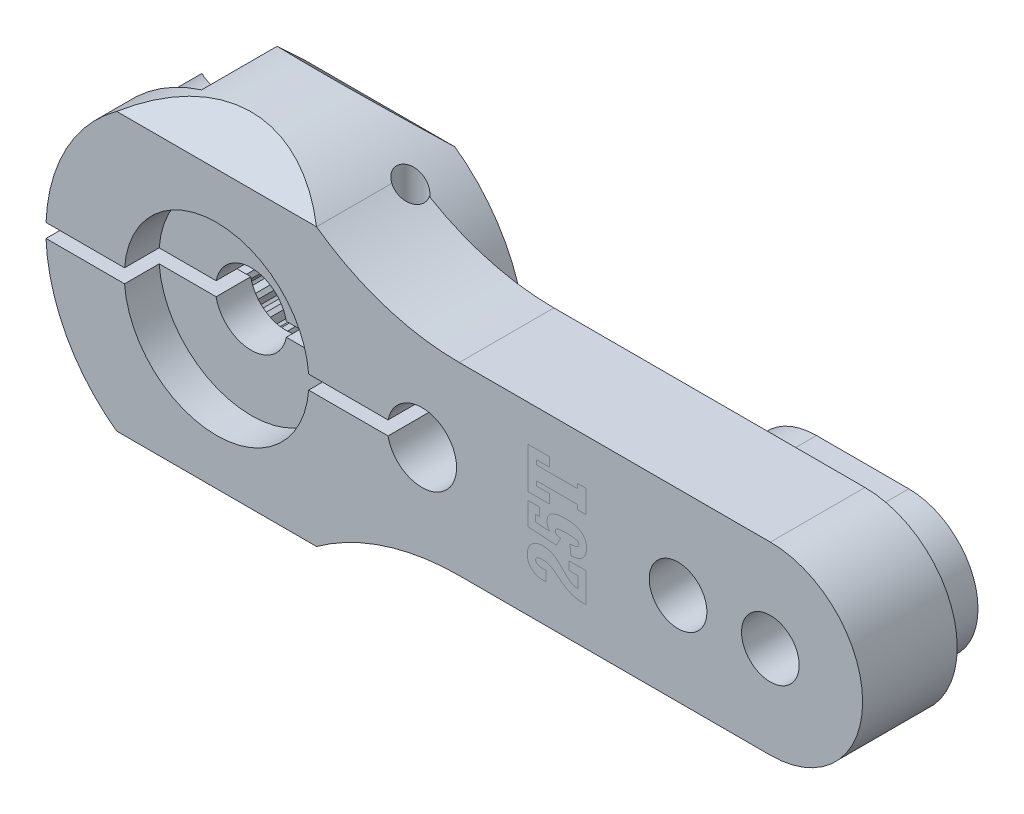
from build123d import *

# Parameters (mm, degrees)
SKETCH1_R                    = 7.4
SKETCH1_R_2                  = 1.55
BOSS_EXTRUDE1_DEPTH          = 6
SKETCH2_R                    = 1.55
BOSS_EXTRUDE2_DEPTH          = 4.1
BOSS_EXTRUDE3_DEPTH          = 7
CUT_EXTRUDE1_START           = -3
SKETCH4_R                    = 2.65
CUT_EXTRUDE1_DEPTH           = 27.795301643
CHAMFER1_SIZE                = 0.45
CUT_EXTRUDE2_START           = -3
CUT_EXTRUDE2_DEPTH           = 27.795301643
CIRPATTERN1_COUNT            = 25
CUT_EXTRUDE3_START           = -1.6
CUT_EXTRUDE3_DEPTH           = 29.195301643
CUT_EXTRUDE4_DEPTH           = 30.795301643
CUT_EXTRUDE4_DEPTH_BACK      = 30.795301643
SKETCH7_R                    = 0.6
SKETCH8_R                    = 1.5
SKETCH8_R_2                  = 1.25
CUT_EXTRUDE5_DEPTH           = 30.795301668
CUT_EXTRUDE6_DEPTH           = 30.795301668
CUT_EXTRUDE6_DEPTH_BACK      = 30.795301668
SKETCH9_W                    = 20.948807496
SKETCH9_H                    = 0.6
CUT_EXTRUDE_THIN1_DEPTH      = 30.795301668
CUT_EXTRUDE_THIN1_DEPTH_BACK = 30.795301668
SKETCH11_R                   = 4
CUT_EXTRUDE7_DEPTH           = 1.5


with BuildPart() as part:
    # Sketch1 → Boss-Extrude1 (new body)
    with BuildSketch(Plane.XY):
        Circle(SKETCH1_R)
        Circle(SKETCH1_R_2, mode=Mode.SUBTRACT)
    extrude(amount=-BOSS_EXTRUDE1_DEPTH)

    # Sketch2 → Boss-Extrude2 (add)
    with BuildSketch(Plane.XY):
        with BuildLine():
            Line((24, 4), (10.518826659, 4))
            ThreePointArc((10.518826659, 4), (7.267453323, 4.512419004), (4.331281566, 6))
            ThreePointArc((4.331281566, 6), (-7.4, 0), (4.331281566, -6))
            ThreePointArc((4.331281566, -6), (7.267453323, -4.512419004), (10.518826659, -4))
            Line((10.518826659, -4), (24, -4))
            ThreePointArc((24, -4), (28, 0), (24, 4))
        make_face()
        Circle(SKETCH2_R, mode=Mode.SUBTRACT)
    extrude(amount=-BOSS_EXTRUDE2_DEPTH)

    # Sketch3 → Boss-Extrude3 (add)
    with BuildSketch(Plane.XY):
        with BuildLine():
            Line((20, 3), (24, 3))
            ThreePointArc((24, 3), (27, 0), (24, -3))
            Line((24, -3), (20, -3))
            ThreePointArc((20, -3), (17, 0), (20, 3))
        make_face()
    extrude(amount=-BOSS_EXTRUDE3_DEPTH)

    # Sketch4 → Cut-Extrude1 (cut, through all)
    with BuildSketch(Plane.XY.offset(CUT_EXTRUDE1_START)):
        Circle(SKETCH4_R)
    extrude(amount=-CUT_EXTRUDE1_DEPTH, mode=Mode.SUBTRACT)

    # Chamfer1
    chamfer1_edges = [part.edges().sort_by_distance(p)[0] for p in [
        (-2.65, 0, -6),
    ]]
    chamfer(chamfer1_edges, length=CHAMFER1_SIZE)

    # Sketch5 → Cut-Extrude2 (cut, through all)
    with BuildSketch(Plane.XY.offset(CUT_EXTRUDE2_START)):
        with BuildLine():
            Line((0.100653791, 2.648087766), (0.320281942, 3.033136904))
            ThreePointArc((0.320281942, 3.033136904), (0.382266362, 3.025949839), (0.444090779, 3.01749621))
            Line((0.444090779, 3.01749621), (0.561061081, 2.589924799))
            ThreePointArc((0.561061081, 2.589924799), (0.332133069, 2.629103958), (0.100653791, 2.648087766))
        make_face()
    cut_extrude2 = extrude(amount=-CUT_EXTRUDE2_DEPTH, mode=Mode.SUBTRACT)

    # CirPattern1: Cut-Extrude2 ×25 about axis
    cirpattern1_axis = Axis((0, 0, 0), (0, 0, 1))
    for i in range(1, CIRPATTERN1_COUNT):
        add(cut_extrude2.rotate(cirpattern1_axis, i * 360 / CIRPATTERN1_COUNT), mode=Mode.SUBTRACT)

    # Sketch6 → Cut-Extrude3 (cut, through all)
    with BuildSketch(Plane.XY.offset(CUT_EXTRUDE3_START)):
        with BuildLine():
            Line((3.25, -3), (5.95, -3))
            ThreePointArc((5.95, -3), (6.657106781, -3.292893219), (6.95, -4))
            Line((6.95, -4), (6.95, -12.29125861))
            Line((6.95, -12.29125861), (2.25, -12.29125861))
            Line((2.25, -12.29125861), (2.25, -4))
            ThreePointArc((2.25, -4), (2.542893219, -3.292893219), (3.25, -3))
        make_face()
        with BuildLine():
            Line((-6.95, 12.29125861), (-2.25, 12.29125861))
            Line((-2.25, 12.29125861), (-2.25, 4))
            ThreePointArc((-2.25, 4), (-2.542893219, 3.292893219), (-3.25, 3))
            Line((-3.25, 3), (-5.95, 3))
            ThreePointArc((-5.95, 3), (-6.657106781, 3.292893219), (-6.95, 4))
            Line((-6.95, 4), (-6.95, 12.29125861))
        make_face()
    extrude(amount=-CUT_EXTRUDE3_DEPTH, mode=Mode.SUBTRACT)

    # Sketch7 → Cut-Extrude4 (cut, two sides: drawn at the far end of the back side and taken through both)
    with BuildSketch(Plane(origin=(0, 0, 0), x_dir=(1, 0, 0), z_dir=(0, 1, 0)).offset(-CUT_EXTRUDE4_DEPTH_BACK)):
        with Locations(Location((-4.6, 3.8, 0), (0, 0, 270))):
            Circle(SKETCH7_R)
        with Locations(Location((4.6, 3.8, 0), (0, 0, 243.393273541))):
            Circle(SKETCH7_R)
    extrude(amount=CUT_EXTRUDE4_DEPTH + CUT_EXTRUDE4_DEPTH_BACK, mode=Mode.SUBTRACT)

    # Sketch8 → Cut-Extrude5 (cut, through all)
    with BuildSketch(Plane.XY):
        with Locations((8.9, 0)):
            Circle(SKETCH8_R)
        with Locations((20, 0)):
            Circle(SKETCH8_R_2)
        with Locations((24, 0)):
            Circle(SKETCH8_R_2)
    extrude(amount=-CUT_EXTRUDE5_DEPTH, mode=Mode.SUBTRACT)

    # Sketch9 → Cut-Extrude6 (cut, two sides: drawn at the far end of the back side and taken through both)
    with BuildSketch(Plane.XY.offset(-CUT_EXTRUDE6_DEPTH_BACK)):
        with Locations((-1.574403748, 0)):
            Rectangle(SKETCH9_W, SKETCH9_H)
    extrude(amount=CUT_EXTRUDE6_DEPTH + CUT_EXTRUDE6_DEPTH_BACK, mode=Mode.SUBTRACT)

    # Sketch10 → Cut-Extrude-Thin1 (cut, two sides: drawn at the far end of the back side and taken through both)
    with BuildSketch(Plane(origin=(0, 0, 0), x_dir=(0, 0, -1), z_dir=(1, 0, 0)).offset(-CUT_EXTRUDE_THIN1_DEPTH_BACK)):
        Polygon((-10, 10.345523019), (-10, -10.345523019), (-2.441631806, -17.4), (8.441631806, -17.4), (16, -10.345523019), (16, 10.345523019), (8.441631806, 17.4), (-2.441631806, 17.4), align=None)
        Polygon((0, 6), (0, -6), (1.5, -7.4), (4.5, -7.4), (6, -6), (6, 6), (4.5, 7.4), (1.5, 7.4), align=None, mode=Mode.SUBTRACT)
    extrude(amount=CUT_EXTRUDE_THIN1_DEPTH + CUT_EXTRUDE_THIN1_DEPTH_BACK, mode=Mode.SUBTRACT)

    # Sketch11 → Cut-Extrude7 (cut)
    with BuildSketch(Plane.XY):
        Circle(SKETCH11_R)
    extrude(amount=-CUT_EXTRUDE7_DEPTH, mode=Mode.SUBTRACT)


solid = part.part
